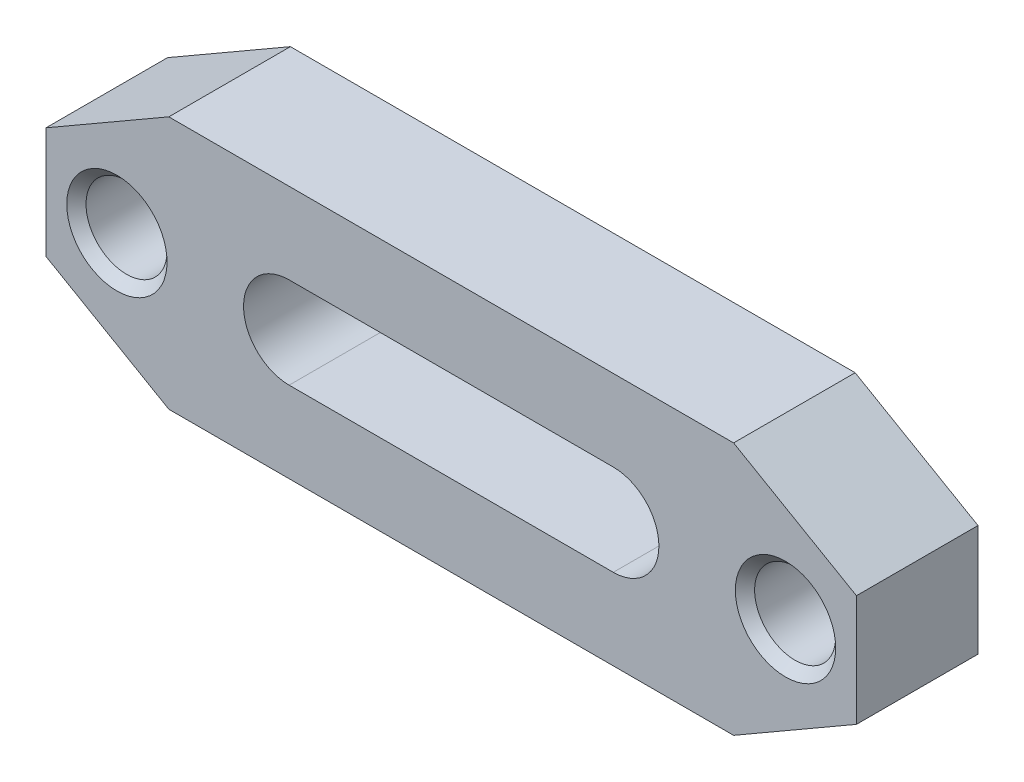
ISO-10303-21;
HEADER;
FILE_DESCRIPTION(('STEP AP214'),'2;1');
FILE_NAME('part.step','',(''),(''),'','','');
FILE_SCHEMA(('AUTOMOTIVE_DESIGN { 1 0 10303 214 1 1 1 1 }'));
ENDSEC;
DATA;
#1=APPLICATION_CONTEXT('core data for automotive mechanical design processes');
#2=APPLICATION_PROTOCOL_DEFINITION('international standard','automotive_design',2000,#1);
#3=PRODUCT_CONTEXT('',#1,'mechanical');
#4=PRODUCT('Part','Part','',(#3));
#5=PRODUCT_RELATED_PRODUCT_CATEGORY('part','',(#4));
#6=PRODUCT_DEFINITION_FORMATION('','',#4);
#7=PRODUCT_DEFINITION_CONTEXT('part definition',#1,'design');
#8=PRODUCT_DEFINITION('design','',#6,#7);
#9=PRODUCT_DEFINITION_SHAPE('','',#8);
#10=(LENGTH_UNIT() NAMED_UNIT(*) SI_UNIT(.MILLI.,.METRE.));
#11=(NAMED_UNIT(*) PLANE_ANGLE_UNIT() SI_UNIT($,.RADIAN.));
#12=(NAMED_UNIT(*) SI_UNIT($,.STERADIAN.) SOLID_ANGLE_UNIT());
#13=UNCERTAINTY_MEASURE_WITH_UNIT(LENGTH_MEASURE(1.E-05),#10,'distance_accuracy_value','');
#14=(GEOMETRIC_REPRESENTATION_CONTEXT(3) GLOBAL_UNCERTAINTY_ASSIGNED_CONTEXT((#13)) GLOBAL_UNIT_ASSIGNED_CONTEXT((#10,
#11,#12)) REPRESENTATION_CONTEXT('',''));
#15=CARTESIAN_POINT('',(0.,0.,0.));
#16=DIRECTION('',(0.,0.,1.));
#17=DIRECTION('',(1.,0.,0.));
#18=AXIS2_PLACEMENT_3D('',#15,#16,#17);
#19=CARTESIAN_POINT('',(40.,-12.5,12.));
#20=DIRECTION('',(0.,0.,1.));
#21=DIRECTION('',(1.,0.,0.));
#22=AXIS2_PLACEMENT_3D('',#19,#20,#21);
#23=PLANE('',#22);
#24=CARTESIAN_POINT('',(33.,0.,12.));
#25=DIRECTION('',(0.,0.,-1.));
#26=DIRECTION('',(-1.,0.,0.));
#27=AXIS2_PLACEMENT_3D('',#24,#25,#26);
#28=CIRCLE('',#27,4.95);
#29=CARTESIAN_POINT('',(28.05,0.,12.));
#30=VERTEX_POINT('',#29);
#31=EDGE_CURVE('E212',#30,#30,#28,.T.);
#32=ORIENTED_EDGE('',*,*,#31,.T.);
#33=EDGE_LOOP('',(#32));
#34=FACE_BOUND('',#33,.T.);
#35=CARTESIAN_POINT('',(-33.,0.,12.));
#36=DIRECTION('',(0.,0.,-1.));
#37=DIRECTION('',(-1.,0.,0.));
#38=AXIS2_PLACEMENT_3D('',#35,#36,#37);
#39=CIRCLE('',#38,4.95);
#40=CARTESIAN_POINT('',(-37.95,0.,12.));
#41=VERTEX_POINT('',#40);
#42=EDGE_CURVE('E133',#41,#41,#39,.T.);
#43=ORIENTED_EDGE('',*,*,#42,.T.);
#44=EDGE_LOOP('',(#43));
#45=FACE_BOUND('',#44,.T.);
#46=DIRECTION('',(1.,0.,0.));
#47=VECTOR('',#46,1.);
#48=CARTESIAN_POINT('',(-27.8756443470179,-12.5,12.));
#49=LINE('',#48,#47);
#50=CARTESIAN_POINT('',(-27.8756443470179,-12.5,12.));
#51=VERTEX_POINT('',#50);
#52=CARTESIAN_POINT('',(27.8756443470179,-12.5,12.));
#53=VERTEX_POINT('',#52);
#54=EDGE_CURVE('E143',#51,#53,#49,.T.);
#55=ORIENTED_EDGE('',*,*,#54,.T.);
#56=DIRECTION('',(0.866025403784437,0.5,0.));
#57=VECTOR('',#56,1.);
#58=CARTESIAN_POINT('',(27.8756443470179,-12.5,12.));
#59=LINE('',#58,#57);
#60=CARTESIAN_POINT('',(40.,-5.5,12.));
#61=VERTEX_POINT('',#60);
#62=EDGE_CURVE('E146',#53,#61,#59,.T.);
#63=ORIENTED_EDGE('',*,*,#62,.T.);
#64=DIRECTION('',(0.,1.,0.));
#65=VECTOR('',#64,1.);
#66=CARTESIAN_POINT('',(40.,-5.5,12.));
#67=LINE('',#66,#65);
#68=CARTESIAN_POINT('',(40.,5.5,12.));
#69=VERTEX_POINT('',#68);
#70=EDGE_CURVE('E149',#61,#69,#67,.T.);
#71=ORIENTED_EDGE('',*,*,#70,.T.);
#72=DIRECTION('',(-0.866025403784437,0.5,0.));
#73=VECTOR('',#72,1.);
#74=CARTESIAN_POINT('',(27.8756443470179,12.5,12.));
#75=LINE('',#74,#73);
#76=CARTESIAN_POINT('',(27.8756443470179,12.5,12.));
#77=VERTEX_POINT('',#76);
#78=EDGE_CURVE('E151',#69,#77,#75,.T.);
#79=ORIENTED_EDGE('',*,*,#78,.T.);
#80=DIRECTION('',(-1.,0.,0.));
#81=VECTOR('',#80,1.);
#82=CARTESIAN_POINT('',(-27.8756443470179,12.5,12.));
#83=LINE('',#82,#81);
#84=CARTESIAN_POINT('',(-27.8756443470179,12.5,12.));
#85=VERTEX_POINT('',#84);
#86=EDGE_CURVE('E153',#77,#85,#83,.T.);
#87=ORIENTED_EDGE('',*,*,#86,.T.);
#88=DIRECTION('',(-0.866025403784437,-0.5,0.));
#89=VECTOR('',#88,1.);
#90=CARTESIAN_POINT('',(-27.8756443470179,12.5,12.));
#91=LINE('',#90,#89);
#92=CARTESIAN_POINT('',(-40.,5.5,12.));
#93=VERTEX_POINT('',#92);
#94=EDGE_CURVE('E155',#85,#93,#91,.T.);
#95=ORIENTED_EDGE('',*,*,#94,.T.);
#96=DIRECTION('',(0.,-1.,0.));
#97=VECTOR('',#96,1.);
#98=CARTESIAN_POINT('',(-40.,-5.5,12.));
#99=LINE('',#98,#97);
#100=CARTESIAN_POINT('',(-40.,-5.5,12.));
#101=VERTEX_POINT('',#100);
#102=EDGE_CURVE('E157',#93,#101,#99,.T.);
#103=ORIENTED_EDGE('',*,*,#102,.T.);
#104=DIRECTION('',(0.866025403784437,-0.5,0.));
#105=VECTOR('',#104,1.);
#106=CARTESIAN_POINT('',(-27.8756443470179,-12.5,12.));
#107=LINE('',#106,#105);
#108=EDGE_CURVE('E159',#101,#51,#107,.T.);
#109=ORIENTED_EDGE('',*,*,#108,.T.);
#110=EDGE_LOOP('',(#55,#63,#71,#79,#87,#95,#103,#109));
#111=FACE_BOUND('',#110,.T.);
#112=DIRECTION('',(-1.,0.,0.));
#113=VECTOR('',#112,1.);
#114=CARTESIAN_POINT('',(16.,4.5,12.));
#115=LINE('',#114,#113);
#116=CARTESIAN_POINT('',(16.,4.5,12.));
#117=VERTEX_POINT('',#116);
#118=CARTESIAN_POINT('',(-16.,4.5,12.));
#119=VERTEX_POINT('',#118);
#120=EDGE_CURVE('E113',#117,#119,#115,.T.);
#121=ORIENTED_EDGE('',*,*,#120,.F.);
#122=CARTESIAN_POINT('',(16.,0.,12.));
#123=DIRECTION('',(0.,0.,1.));
#124=DIRECTION('',(1.,0.,0.));
#125=AXIS2_PLACEMENT_3D('',#122,#123,#124);
#126=CIRCLE('',#125,4.5);
#127=CARTESIAN_POINT('',(16.,-4.5,12.));
#128=VERTEX_POINT('',#127);
#129=EDGE_CURVE('E105',#128,#117,#126,.T.);
#130=ORIENTED_EDGE('',*,*,#129,.F.);
#131=DIRECTION('',(1.,0.,0.));
#132=VECTOR('',#131,1.);
#133=CARTESIAN_POINT('',(16.,-4.5,12.));
#134=LINE('',#133,#132);
#135=CARTESIAN_POINT('',(-16.,-4.5,12.));
#136=VERTEX_POINT('',#135);
#137=EDGE_CURVE('E127',#136,#128,#134,.T.);
#138=ORIENTED_EDGE('',*,*,#137,.F.);
#139=CARTESIAN_POINT('',(-16.,0.,12.));
#140=DIRECTION('',(0.,0.,1.));
#141=DIRECTION('',(1.,0.,0.));
#142=AXIS2_PLACEMENT_3D('',#139,#140,#141);
#143=CIRCLE('',#142,4.5);
#144=EDGE_CURVE('E125',#119,#136,#143,.T.);
#145=ORIENTED_EDGE('',*,*,#144,.F.);
#146=EDGE_LOOP('',(#121,#130,#138,#145));
#147=FACE_BOUND('',#146,.T.);
#148=ADVANCED_FACE('F14',(#34,#45,#111,#147),#23,.T.);
#149=CARTESIAN_POINT('',(40.,-12.5,0.));
#150=DIRECTION('',(0.,0.,1.));
#151=DIRECTION('',(1.,0.,0.));
#152=AXIS2_PLACEMENT_3D('',#149,#150,#151);
#153=PLANE('',#152);
#154=CARTESIAN_POINT('',(33.,0.,0.));
#155=DIRECTION('',(0.,0.,-1.));
#156=DIRECTION('',(-1.,0.,0.));
#157=AXIS2_PLACEMENT_3D('',#154,#155,#156);
#158=CIRCLE('',#157,4.95);
#159=CARTESIAN_POINT('',(28.05,0.,0.));
#160=VERTEX_POINT('',#159);
#161=EDGE_CURVE('E202',#160,#160,#158,.T.);
#162=ORIENTED_EDGE('',*,*,#161,.F.);
#163=EDGE_LOOP('',(#162));
#164=FACE_BOUND('',#163,.T.);
#165=CARTESIAN_POINT('',(-33.,0.,0.));
#166=DIRECTION('',(0.,0.,-1.));
#167=DIRECTION('',(-1.,0.,0.));
#168=AXIS2_PLACEMENT_3D('',#165,#166,#167);
#169=CIRCLE('',#168,4.95);
#170=CARTESIAN_POINT('',(-37.95,0.,0.));
#171=VERTEX_POINT('',#170);
#172=EDGE_CURVE('E215',#171,#171,#169,.T.);
#173=ORIENTED_EDGE('',*,*,#172,.F.);
#174=EDGE_LOOP('',(#173));
#175=FACE_BOUND('',#174,.T.);
#176=DIRECTION('',(1.,0.,0.));
#177=VECTOR('',#176,1.);
#178=CARTESIAN_POINT('',(-27.8756443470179,-12.5,0.));
#179=LINE('',#178,#177);
#180=CARTESIAN_POINT('',(-27.8756443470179,-12.5,0.));
#181=VERTEX_POINT('',#180);
#182=CARTESIAN_POINT('',(27.8756443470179,-12.5,0.));
#183=VERTEX_POINT('',#182);
#184=EDGE_CURVE('E121',#181,#183,#179,.T.);
#185=ORIENTED_EDGE('',*,*,#184,.F.);
#186=DIRECTION('',(0.866025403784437,-0.5,0.));
#187=VECTOR('',#186,1.);
#188=CARTESIAN_POINT('',(-27.8756443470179,-12.5,0.));
#189=LINE('',#188,#187);
#190=CARTESIAN_POINT('',(-40.,-5.5,0.));
#191=VERTEX_POINT('',#190);
#192=EDGE_CURVE('E147',#191,#181,#189,.T.);
#193=ORIENTED_EDGE('',*,*,#192,.F.);
#194=DIRECTION('',(0.,-1.,0.));
#195=VECTOR('',#194,1.);
#196=CARTESIAN_POINT('',(-40.,-5.5,0.));
#197=LINE('',#196,#195);
#198=CARTESIAN_POINT('',(-40.,5.5,0.));
#199=VERTEX_POINT('',#198);
#200=EDGE_CURVE('E174',#199,#191,#197,.T.);
#201=ORIENTED_EDGE('',*,*,#200,.F.);
#202=DIRECTION('',(-0.866025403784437,-0.5,0.));
#203=VECTOR('',#202,1.);
#204=CARTESIAN_POINT('',(-27.8756443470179,12.5,0.));
#205=LINE('',#204,#203);
#206=CARTESIAN_POINT('',(-27.8756443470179,12.5,0.));
#207=VERTEX_POINT('',#206);
#208=EDGE_CURVE('E172',#207,#199,#205,.T.);
#209=ORIENTED_EDGE('',*,*,#208,.F.);
#210=DIRECTION('',(-1.,0.,0.));
#211=VECTOR('',#210,1.);
#212=CARTESIAN_POINT('',(-27.8756443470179,12.5,0.));
#213=LINE('',#212,#211);
#214=CARTESIAN_POINT('',(27.8756443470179,12.5,0.));
#215=VERTEX_POINT('',#214);
#216=EDGE_CURVE('E170',#215,#207,#213,.T.);
#217=ORIENTED_EDGE('',*,*,#216,.F.);
#218=DIRECTION('',(-0.866025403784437,0.5,0.));
#219=VECTOR('',#218,1.);
#220=CARTESIAN_POINT('',(27.8756443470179,12.5,0.));
#221=LINE('',#220,#219);
#222=CARTESIAN_POINT('',(40.,5.5,0.));
#223=VERTEX_POINT('',#222);
#224=EDGE_CURVE('E168',#223,#215,#221,.T.);
#225=ORIENTED_EDGE('',*,*,#224,.F.);
#226=DIRECTION('',(0.,1.,0.));
#227=VECTOR('',#226,1.);
#228=CARTESIAN_POINT('',(40.,-5.5,0.));
#229=LINE('',#228,#227);
#230=CARTESIAN_POINT('',(40.,-5.5,0.));
#231=VERTEX_POINT('',#230);
#232=EDGE_CURVE('E166',#231,#223,#229,.T.);
#233=ORIENTED_EDGE('',*,*,#232,.F.);
#234=DIRECTION('',(0.866025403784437,0.5,0.));
#235=VECTOR('',#234,1.);
#236=CARTESIAN_POINT('',(27.8756443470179,-12.5,0.));
#237=LINE('',#236,#235);
#238=EDGE_CURVE('E164',#183,#231,#237,.T.);
#239=ORIENTED_EDGE('',*,*,#238,.F.);
#240=EDGE_LOOP('',(#185,#193,#201,#209,#217,#225,#233,#239));
#241=FACE_BOUND('',#240,.T.);
#242=CARTESIAN_POINT('',(16.,0.,0.));
#243=DIRECTION('',(0.,0.,1.));
#244=DIRECTION('',(1.,0.,0.));
#245=AXIS2_PLACEMENT_3D('',#242,#243,#244);
#246=CIRCLE('',#245,4.5);
#247=CARTESIAN_POINT('',(16.,-4.5,0.));
#248=VERTEX_POINT('',#247);
#249=CARTESIAN_POINT('',(16.,4.5,0.));
#250=VERTEX_POINT('',#249);
#251=EDGE_CURVE('E39',#248,#250,#246,.T.);
#252=ORIENTED_EDGE('',*,*,#251,.T.);
#253=DIRECTION('',(-1.,0.,0.));
#254=VECTOR('',#253,1.);
#255=CARTESIAN_POINT('',(16.,4.5,0.));
#256=LINE('',#255,#254);
#257=CARTESIAN_POINT('',(-16.,4.5,0.));
#258=VERTEX_POINT('',#257);
#259=EDGE_CURVE('E120',#250,#258,#256,.T.);
#260=ORIENTED_EDGE('',*,*,#259,.T.);
#261=CARTESIAN_POINT('',(-16.,0.,0.));
#262=DIRECTION('',(0.,0.,1.));
#263=DIRECTION('',(1.,0.,0.));
#264=AXIS2_PLACEMENT_3D('',#261,#262,#263);
#265=CIRCLE('',#264,4.5);
#266=CARTESIAN_POINT('',(-16.,-4.5,0.));
#267=VERTEX_POINT('',#266);
#268=EDGE_CURVE('E135',#258,#267,#265,.T.);
#269=ORIENTED_EDGE('',*,*,#268,.T.);
#270=DIRECTION('',(1.,0.,0.));
#271=VECTOR('',#270,1.);
#272=CARTESIAN_POINT('',(16.,-4.5,0.));
#273=LINE('',#272,#271);
#274=EDGE_CURVE('E114',#267,#248,#273,.T.);
#275=ORIENTED_EDGE('',*,*,#274,.T.);
#276=EDGE_LOOP('',(#252,#260,#269,#275));
#277=FACE_BOUND('',#276,.T.);
#278=ADVANCED_FACE('F238',(#164,#175,#241,#277),#153,.F.);
#279=CARTESIAN_POINT('',(-27.8756443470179,-12.5,12.));
#280=DIRECTION('',(0.,1.,0.));
#281=DIRECTION('',(-1.,0.,0.));
#282=AXIS2_PLACEMENT_3D('',#279,#280,#281);
#283=PLANE('',#282);
#284=ORIENTED_EDGE('',*,*,#184,.T.);
#285=DIRECTION('',(0.,0.,-1.));
#286=VECTOR('',#285,1.);
#287=CARTESIAN_POINT('',(27.8756443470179,-12.5,12.));
#288=LINE('',#287,#286);
#289=EDGE_CURVE('E9',#53,#183,#288,.T.);
#290=ORIENTED_EDGE('',*,*,#289,.F.);
#291=ORIENTED_EDGE('',*,*,#54,.F.);
#292=DIRECTION('',(0.,0.,-1.));
#293=VECTOR('',#292,1.);
#294=CARTESIAN_POINT('',(-27.8756443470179,-12.5,12.));
#295=LINE('',#294,#293);
#296=EDGE_CURVE('E161',#51,#181,#295,.T.);
#297=ORIENTED_EDGE('',*,*,#296,.T.);
#298=EDGE_LOOP('',(#284,#290,#291,#297));
#299=FACE_BOUND('',#298,.T.);
#300=ADVANCED_FACE('F16',(#299),#283,.F.);
#301=CARTESIAN_POINT('',(27.8756443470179,-12.5,12.));
#302=DIRECTION('',(-0.5,0.866025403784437,0.));
#303=DIRECTION('',(-0.866025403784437,-0.5,0.));
#304=AXIS2_PLACEMENT_3D('',#301,#302,#303);
#305=PLANE('',#304);
#306=ORIENTED_EDGE('',*,*,#238,.T.);
#307=DIRECTION('',(0.,0.,-1.));
#308=VECTOR('',#307,1.);
#309=CARTESIAN_POINT('',(40.,-5.5,12.));
#310=LINE('',#309,#308);
#311=EDGE_CURVE('E23',#61,#231,#310,.T.);
#312=ORIENTED_EDGE('',*,*,#311,.F.);
#313=ORIENTED_EDGE('',*,*,#62,.F.);
#314=ORIENTED_EDGE('',*,*,#289,.T.);
#315=EDGE_LOOP('',(#306,#312,#313,#314));
#316=FACE_BOUND('',#315,.T.);
#317=ADVANCED_FACE('F271',(#316),#305,.F.);
#318=CARTESIAN_POINT('',(40.,-5.5,12.));
#319=DIRECTION('',(-1.,0.,0.));
#320=DIRECTION('',(0.,0.,1.));
#321=AXIS2_PLACEMENT_3D('',#318,#319,#320);
#322=PLANE('',#321);
#323=ORIENTED_EDGE('',*,*,#232,.T.);
#324=DIRECTION('',(0.,0.,-1.));
#325=VECTOR('',#324,1.);
#326=CARTESIAN_POINT('',(40.,5.5,12.));
#327=LINE('',#326,#325);
#328=EDGE_CURVE('E191',#69,#223,#327,.T.);
#329=ORIENTED_EDGE('',*,*,#328,.F.);
#330=ORIENTED_EDGE('',*,*,#70,.F.);
#331=ORIENTED_EDGE('',*,*,#311,.T.);
#332=EDGE_LOOP('',(#323,#329,#330,#331));
#333=FACE_BOUND('',#332,.T.);
#334=ADVANCED_FACE('F268',(#333),#322,.F.);
#335=CARTESIAN_POINT('',(27.8756443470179,12.5,12.));
#336=DIRECTION('',(-0.5,-0.866025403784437,0.));
#337=DIRECTION('',(0.866025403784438,-0.5,0.));
#338=AXIS2_PLACEMENT_3D('',#335,#336,#337);
#339=PLANE('',#338);
#340=ORIENTED_EDGE('',*,*,#224,.T.);
#341=DIRECTION('',(0.,0.,-1.));
#342=VECTOR('',#341,1.);
#343=CARTESIAN_POINT('',(27.8756443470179,12.5,12.));
#344=LINE('',#343,#342);
#345=EDGE_CURVE('E188',#77,#215,#344,.T.);
#346=ORIENTED_EDGE('',*,*,#345,.F.);
#347=ORIENTED_EDGE('',*,*,#78,.F.);
#348=ORIENTED_EDGE('',*,*,#328,.T.);
#349=EDGE_LOOP('',(#340,#346,#347,#348));
#350=FACE_BOUND('',#349,.T.);
#351=ADVANCED_FACE('F264',(#350),#339,.F.);
#352=CARTESIAN_POINT('',(-27.8756443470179,12.5,12.));
#353=DIRECTION('',(0.,-1.,0.));
#354=DIRECTION('',(0.,0.,-1.));
#355=AXIS2_PLACEMENT_3D('',#352,#353,#354);
#356=PLANE('',#355);
#357=ORIENTED_EDGE('',*,*,#216,.T.);
#358=DIRECTION('',(0.,0.,-1.));
#359=VECTOR('',#358,1.);
#360=CARTESIAN_POINT('',(-27.8756443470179,12.5,12.));
#361=LINE('',#360,#359);
#362=EDGE_CURVE('E185',#85,#207,#361,.T.);
#363=ORIENTED_EDGE('',*,*,#362,.F.);
#364=ORIENTED_EDGE('',*,*,#86,.F.);
#365=ORIENTED_EDGE('',*,*,#345,.T.);
#366=EDGE_LOOP('',(#357,#363,#364,#365));
#367=FACE_BOUND('',#366,.T.);
#368=ADVANCED_FACE('F260',(#367),#356,.F.);
#369=CARTESIAN_POINT('',(-27.8756443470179,12.5,12.));
#370=DIRECTION('',(0.5,-0.866025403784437,0.));
#371=DIRECTION('',(0.866025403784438,0.5,0.));
#372=AXIS2_PLACEMENT_3D('',#369,#370,#371);
#373=PLANE('',#372);
#374=ORIENTED_EDGE('',*,*,#208,.T.);
#375=DIRECTION('',(0.,0.,-1.));
#376=VECTOR('',#375,1.);
#377=CARTESIAN_POINT('',(-40.,5.5,12.));
#378=LINE('',#377,#376);
#379=EDGE_CURVE('E182',#93,#199,#378,.T.);
#380=ORIENTED_EDGE('',*,*,#379,.F.);
#381=ORIENTED_EDGE('',*,*,#94,.F.);
#382=ORIENTED_EDGE('',*,*,#362,.T.);
#383=EDGE_LOOP('',(#374,#380,#381,#382));
#384=FACE_BOUND('',#383,.T.);
#385=ADVANCED_FACE('F256',(#384),#373,.F.);
#386=CARTESIAN_POINT('',(-40.,-5.5,12.));
#387=DIRECTION('',(1.,0.,0.));
#388=DIRECTION('',(0.,0.,-1.));
#389=AXIS2_PLACEMENT_3D('',#386,#387,#388);
#390=PLANE('',#389);
#391=ORIENTED_EDGE('',*,*,#200,.T.);
#392=DIRECTION('',(0.,0.,-1.));
#393=VECTOR('',#392,1.);
#394=CARTESIAN_POINT('',(-40.,-5.5,12.));
#395=LINE('',#394,#393);
#396=EDGE_CURVE('E179',#101,#191,#395,.T.);
#397=ORIENTED_EDGE('',*,*,#396,.F.);
#398=ORIENTED_EDGE('',*,*,#102,.F.);
#399=ORIENTED_EDGE('',*,*,#379,.T.);
#400=EDGE_LOOP('',(#391,#397,#398,#399));
#401=FACE_BOUND('',#400,.T.);
#402=ADVANCED_FACE('F252',(#401),#390,.F.);
#403=CARTESIAN_POINT('',(-27.8756443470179,-12.5,12.));
#404=DIRECTION('',(0.5,0.866025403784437,0.));
#405=DIRECTION('',(-0.866025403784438,0.5,0.));
#406=AXIS2_PLACEMENT_3D('',#403,#404,#405);
#407=PLANE('',#406);
#408=ORIENTED_EDGE('',*,*,#192,.T.);
#409=ORIENTED_EDGE('',*,*,#296,.F.);
#410=ORIENTED_EDGE('',*,*,#108,.F.);
#411=ORIENTED_EDGE('',*,*,#396,.T.);
#412=EDGE_LOOP('',(#408,#409,#410,#411));
#413=FACE_BOUND('',#412,.T.);
#414=ADVANCED_FACE('F249',(#413),#407,.F.);
#415=CARTESIAN_POINT('',(16.,0.,12.));
#416=DIRECTION('',(0.,0.,-1.));
#417=DIRECTION('',(-1.,0.,0.));
#418=AXIS2_PLACEMENT_3D('',#415,#416,#417);
#419=CYLINDRICAL_SURFACE('',#418,4.5);
#420=ORIENTED_EDGE('',*,*,#251,.F.);
#421=DIRECTION('',(0.,0.,-1.));
#422=VECTOR('',#421,1.);
#423=CARTESIAN_POINT('',(16.,-4.5,12.));
#424=LINE('',#423,#422);
#425=EDGE_CURVE('E109',#128,#248,#424,.T.);
#426=ORIENTED_EDGE('',*,*,#425,.F.);
#427=ORIENTED_EDGE('',*,*,#129,.T.);
#428=DIRECTION('',(0.,0.,-1.));
#429=VECTOR('',#428,1.);
#430=CARTESIAN_POINT('',(16.,4.5,12.));
#431=LINE('',#430,#429);
#432=EDGE_CURVE('E108',#117,#250,#431,.T.);
#433=ORIENTED_EDGE('',*,*,#432,.T.);
#434=EDGE_LOOP('',(#420,#426,#427,#433));
#435=FACE_BOUND('',#434,.T.);
#436=ADVANCED_FACE('F107',(#435),#419,.F.);
#437=CARTESIAN_POINT('',(16.,4.5,12.));
#438=DIRECTION('',(0.,-1.,0.));
#439=DIRECTION('',(1.,0.,0.));
#440=AXIS2_PLACEMENT_3D('',#437,#438,#439);
#441=PLANE('',#440);
#442=ORIENTED_EDGE('',*,*,#259,.F.);
#443=ORIENTED_EDGE('',*,*,#432,.F.);
#444=ORIENTED_EDGE('',*,*,#120,.T.);
#445=DIRECTION('',(0.,0.,-1.));
#446=VECTOR('',#445,1.);
#447=CARTESIAN_POINT('',(-16.,4.5,12.));
#448=LINE('',#447,#446);
#449=EDGE_CURVE('E122',#119,#258,#448,.T.);
#450=ORIENTED_EDGE('',*,*,#449,.T.);
#451=EDGE_LOOP('',(#442,#443,#444,#450));
#452=FACE_BOUND('',#451,.T.);
#453=ADVANCED_FACE('F117',(#452),#441,.T.);
#454=CARTESIAN_POINT('',(-16.,0.,12.));
#455=DIRECTION('',(0.,0.,-1.));
#456=DIRECTION('',(-1.,0.,0.));
#457=AXIS2_PLACEMENT_3D('',#454,#455,#456);
#458=CYLINDRICAL_SURFACE('',#457,4.5);
#459=ORIENTED_EDGE('',*,*,#268,.F.);
#460=ORIENTED_EDGE('',*,*,#449,.F.);
#461=ORIENTED_EDGE('',*,*,#144,.T.);
#462=DIRECTION('',(0.,0.,-1.));
#463=VECTOR('',#462,1.);
#464=CARTESIAN_POINT('',(-16.,-4.5,12.));
#465=LINE('',#464,#463);
#466=EDGE_CURVE('E31',#136,#267,#465,.T.);
#467=ORIENTED_EDGE('',*,*,#466,.T.);
#468=EDGE_LOOP('',(#459,#460,#461,#467));
#469=FACE_BOUND('',#468,.T.);
#470=ADVANCED_FACE('F235',(#469),#458,.F.);
#471=CARTESIAN_POINT('',(16.,-4.5,12.));
#472=DIRECTION('',(0.,1.,0.));
#473=DIRECTION('',(-1.,0.,0.));
#474=AXIS2_PLACEMENT_3D('',#471,#472,#473);
#475=PLANE('',#474);
#476=ORIENTED_EDGE('',*,*,#274,.F.);
#477=ORIENTED_EDGE('',*,*,#466,.F.);
#478=ORIENTED_EDGE('',*,*,#137,.T.);
#479=ORIENTED_EDGE('',*,*,#425,.T.);
#480=EDGE_LOOP('',(#476,#477,#478,#479));
#481=FACE_BOUND('',#480,.T.);
#482=ADVANCED_FACE('F225',(#481),#475,.T.);
#483=CARTESIAN_POINT('',(-33.,0.,10.5));
#484=DIRECTION('',(0.,0.,1.));
#485=DIRECTION('',(1.,0.,0.));
#486=AXIS2_PLACEMENT_3D('',#483,#484,#485);
#487=CONICAL_SURFACE('',#486,3.45,0.78539816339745);
#488=CARTESIAN_POINT('',(-33.,0.,11.05));
#489=DIRECTION('',(0.,0.,1.));
#490=DIRECTION('',(1.,0.,0.));
#491=AXIS2_PLACEMENT_3D('',#488,#489,#490);
#492=CIRCLE('',#491,4.);
#493=CARTESIAN_POINT('',(-29.,0.,11.05));
#494=VERTEX_POINT('',#493);
#495=EDGE_CURVE('E197',#494,#494,#492,.F.);
#496=ORIENTED_EDGE('',*,*,#495,.T.);
#497=EDGE_LOOP('',(#496));
#498=FACE_BOUND('',#497,.T.);
#499=ORIENTED_EDGE('',*,*,#42,.F.);
#500=EDGE_LOOP('',(#499));
#501=FACE_BOUND('',#500,.T.);
#502=ADVANCED_FACE('F222',(#498,#501),#487,.F.);
#503=CARTESIAN_POINT('',(-33.,0.,0.));
#504=DIRECTION('',(0.,0.,-1.));
#505=DIRECTION('',(-1.,0.,0.));
#506=AXIS2_PLACEMENT_3D('',#503,#504,#505);
#507=CONICAL_SURFACE('',#506,4.95,0.785398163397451);
#508=CARTESIAN_POINT('',(-33.,0.,0.95));
#509=DIRECTION('',(0.,0.,-1.));
#510=DIRECTION('',(-1.,0.,0.));
#511=AXIS2_PLACEMENT_3D('',#508,#509,#510);
#512=CIRCLE('',#511,4.);
#513=CARTESIAN_POINT('',(-37.,0.,0.95));
#514=VERTEX_POINT('',#513);
#515=EDGE_CURVE('E195',#514,#514,#512,.F.);
#516=ORIENTED_EDGE('',*,*,#515,.T.);
#517=EDGE_LOOP('',(#516));
#518=FACE_BOUND('',#517,.T.);
#519=ORIENTED_EDGE('',*,*,#172,.T.);
#520=EDGE_LOOP('',(#519));
#521=FACE_BOUND('',#520,.T.);
#522=ADVANCED_FACE('F224',(#518,#521),#507,.F.);
#523=CARTESIAN_POINT('',(33.,0.,10.5));
#524=DIRECTION('',(0.,0.,1.));
#525=DIRECTION('',(1.,0.,0.));
#526=AXIS2_PLACEMENT_3D('',#523,#524,#525);
#527=CONICAL_SURFACE('',#526,3.45,0.78539816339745);
#528=CARTESIAN_POINT('',(33.,0.,11.05));
#529=DIRECTION('',(0.,0.,1.));
#530=DIRECTION('',(1.,0.,0.));
#531=AXIS2_PLACEMENT_3D('',#528,#529,#530);
#532=CIRCLE('',#531,4.);
#533=CARTESIAN_POINT('',(37.,0.,11.05));
#534=VERTEX_POINT('',#533);
#535=EDGE_CURVE('E198',#534,#534,#532,.F.);
#536=ORIENTED_EDGE('',*,*,#535,.T.);
#537=EDGE_LOOP('',(#536));
#538=FACE_BOUND('',#537,.T.);
#539=ORIENTED_EDGE('',*,*,#31,.F.);
#540=EDGE_LOOP('',(#539));
#541=FACE_BOUND('',#540,.T.);
#542=ADVANCED_FACE('F233',(#538,#541),#527,.F.);
#543=CARTESIAN_POINT('',(33.,0.,0.));
#544=DIRECTION('',(0.,0.,-1.));
#545=DIRECTION('',(-1.,0.,0.));
#546=AXIS2_PLACEMENT_3D('',#543,#544,#545);
#547=CONICAL_SURFACE('',#546,4.95,0.78539816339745);
#548=CARTESIAN_POINT('',(33.,0.,0.949999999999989));
#549=DIRECTION('',(0.,0.,-1.));
#550=DIRECTION('',(-1.,0.,0.));
#551=AXIS2_PLACEMENT_3D('',#548,#549,#550);
#552=CIRCLE('',#551,4.);
#553=CARTESIAN_POINT('',(29.,0.,0.949999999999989));
#554=VERTEX_POINT('',#553);
#555=EDGE_CURVE('E18',#554,#554,#552,.F.);
#556=ORIENTED_EDGE('',*,*,#555,.T.);
#557=EDGE_LOOP('',(#556));
#558=FACE_BOUND('',#557,.T.);
#559=ORIENTED_EDGE('',*,*,#161,.T.);
#560=EDGE_LOOP('',(#559));
#561=FACE_BOUND('',#560,.T.);
#562=ADVANCED_FACE('F398',(#558,#561),#547,.F.);
#563=CARTESIAN_POINT('',(-33.,0.,0.));
#564=DIRECTION('',(0.,0.,1.));
#565=DIRECTION('',(1.,0.,0.));
#566=AXIS2_PLACEMENT_3D('',#563,#564,#565);
#567=CYLINDRICAL_SURFACE('',#566,4.);
#568=ORIENTED_EDGE('',*,*,#515,.F.);
#569=EDGE_LOOP('',(#568));
#570=FACE_BOUND('',#569,.T.);
#571=ORIENTED_EDGE('',*,*,#495,.F.);
#572=EDGE_LOOP('',(#571));
#573=FACE_BOUND('',#572,.T.);
#574=ADVANCED_FACE('F407',(#570,#573),#567,.F.);
#575=CARTESIAN_POINT('',(33.,0.,0.));
#576=DIRECTION('',(0.,0.,1.));
#577=DIRECTION('',(1.,0.,0.));
#578=AXIS2_PLACEMENT_3D('',#575,#576,#577);
#579=CYLINDRICAL_SURFACE('',#578,4.);
#580=ORIENTED_EDGE('',*,*,#555,.F.);
#581=EDGE_LOOP('',(#580));
#582=FACE_BOUND('',#581,.T.);
#583=ORIENTED_EDGE('',*,*,#535,.F.);
#584=EDGE_LOOP('',(#583));
#585=FACE_BOUND('',#584,.T.);
#586=ADVANCED_FACE('F417',(#582,#585),#579,.F.);
#587=CLOSED_SHELL('',(#148,#278,#300,#317,#334,#351,#368,#385,#402,#414,#436,#453,#470,#482,
#502,#522,#542,#562,#574,#586));
#588=MANIFOLD_SOLID_BREP('B1',#587);
#589=ADVANCED_BREP_SHAPE_REPRESENTATION('',(#18,#588),#14);
#590=SHAPE_DEFINITION_REPRESENTATION(#9,#589);
ENDSEC;
END-ISO-10303-21;
